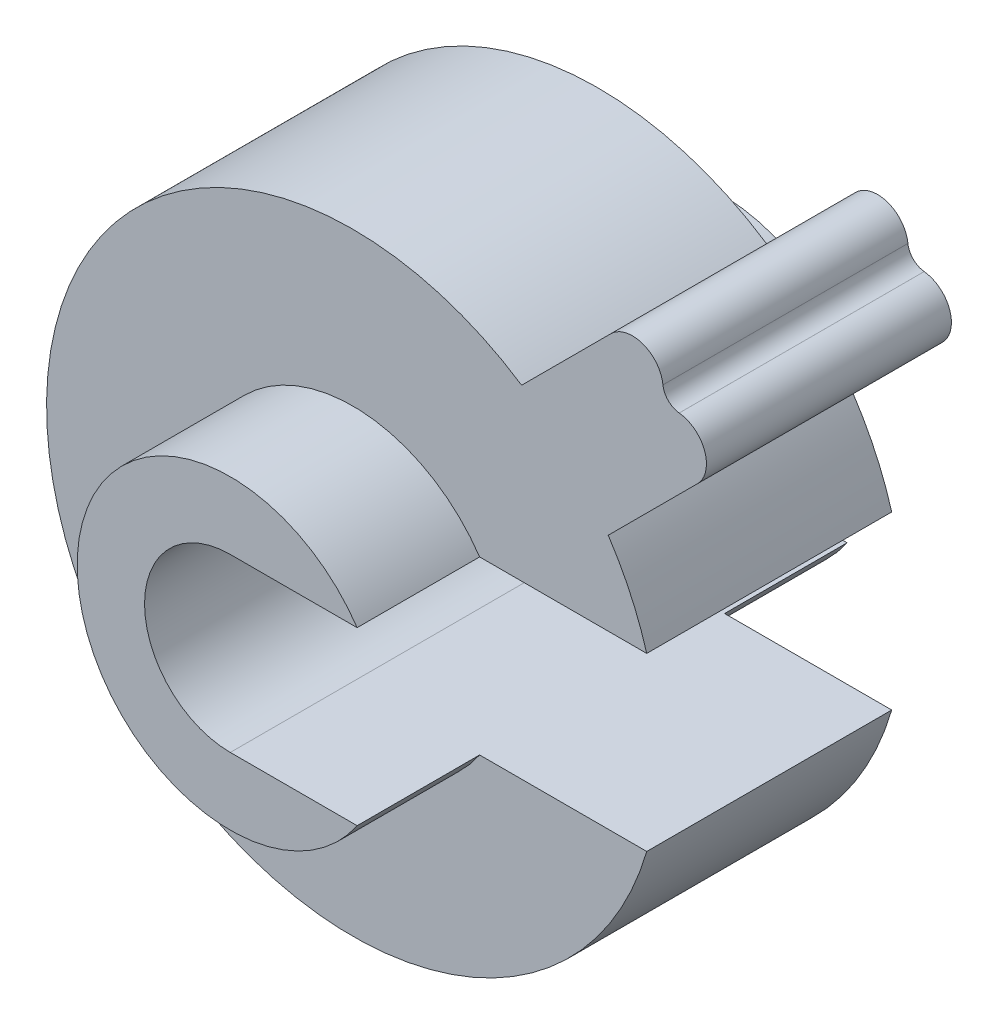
from build123d import *

# Parameters (mm, degrees)
ESQUISSE1_R             = 1.25
BOSS_EXTRU_1_DEPTH      = 2
ESQUISSE2_R             = 2.5
BOSS_EXTRU_2_DEPTH      = 1
ESQUISSE3_R             = 0.7
ENL_V_MAT_EXTRU_1_DEPTH = 4.5
ESQUISSE4_W             = 2.704400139
ESQUISSE4_H             = 1.4
ENL_V_MAT_EXTRU_2_DEPTH = 4.5
BOSS_EXTRU_3_DEPTH      = 2
CONG_1_R                = 0.25
CONG_2_R                = 0.15


with BuildPart() as part:
    # Esquisse1 → Boss.-Extru.1 (new, symmetric)
    with BuildSketch(Plane.XY):
        Circle(ESQUISSE1_R)
    extrude(amount=BOSS_EXTRU_1_DEPTH, both=True)

    # Esquisse2 → Boss.-Extru.2 (add, symmetric)
    with BuildSketch(Plane.XY):
        Circle(ESQUISSE2_R)
    extrude(amount=BOSS_EXTRU_2_DEPTH, both=True)

    # Esquisse3 → Enl_v. mat.-Extru.1 (cut)
    with BuildSketch(Plane.XY.offset(2)):
        Circle(ESQUISSE3_R)
    extrude(amount=-ENL_V_MAT_EXTRU_1_DEPTH, mode=Mode.SUBTRACT)

    # Esquisse4 → Enl_v. mat.-Extru.2 (cut)
    with BuildSketch(Plane.XY.offset(2)):
        with Locations((1.35220007, 0)):
            Rectangle(ESQUISSE4_W, ESQUISSE4_H)
    extrude(amount=-ENL_V_MAT_EXTRU_2_DEPTH, mode=Mode.SUBTRACT)

    # Esquisse5 → Boss.-Extru.3 (add)
    with BuildSketch(Plane.XY.offset(1)):
        Polygon((3.181980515, 2.474873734), (1.767766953, 1.060660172), (1.060660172, 1.767766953), (2.474873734, 3.181980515), (2.545584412, 2.545584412), align=None)
    extrude(amount=-BOSS_EXTRU_3_DEPTH)

    # Cong_1
    cong_1_edges = [part.edges().sort_by_distance(p)[0] for p in [
        (3.181980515, 2.474873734, 0),
        (2.474873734, 3.181980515, 0),
    ]]
    fillet(cong_1_edges, radius=CONG_1_R)

    # Cong_2
    cong_2_edges = [part.edges().sort_by_distance(p)[0] for p in [
        (2.545584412, 2.545584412, 0),
    ]]
    fillet(cong_2_edges, radius=CONG_2_R)


solid = part.part
